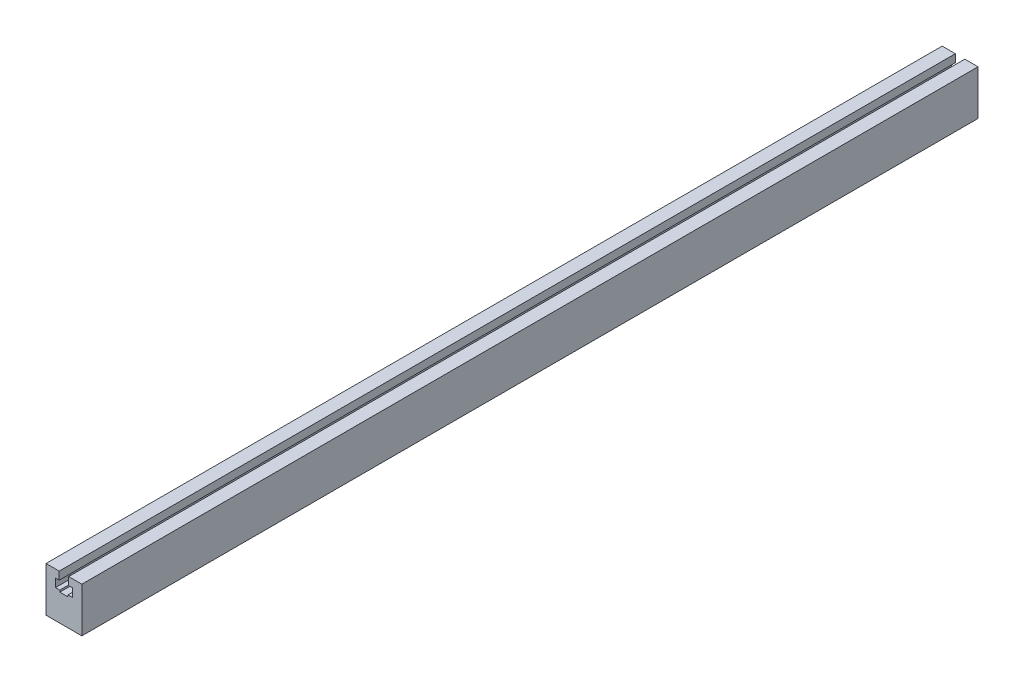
ISO-10303-21;
HEADER;
FILE_DESCRIPTION(('STEP AP214'),'2;1');
FILE_NAME('part.step','',(''),(''),'','','');
FILE_SCHEMA(('AUTOMOTIVE_DESIGN { 1 0 10303 214 1 1 1 1 }'));
ENDSEC;
DATA;
#1=APPLICATION_CONTEXT('core data for automotive mechanical design processes');
#2=APPLICATION_PROTOCOL_DEFINITION('international standard','automotive_design',2000,#1);
#3=PRODUCT_CONTEXT('',#1,'mechanical');
#4=PRODUCT('Part','Part','',(#3));
#5=PRODUCT_RELATED_PRODUCT_CATEGORY('part','',(#4));
#6=PRODUCT_DEFINITION_FORMATION('','',#4);
#7=PRODUCT_DEFINITION_CONTEXT('part definition',#1,'design');
#8=PRODUCT_DEFINITION('design','',#6,#7);
#9=PRODUCT_DEFINITION_SHAPE('','',#8);
#10=(LENGTH_UNIT() NAMED_UNIT(*) SI_UNIT(.MILLI.,.METRE.));
#11=(NAMED_UNIT(*) PLANE_ANGLE_UNIT() SI_UNIT($,.RADIAN.));
#12=(NAMED_UNIT(*) SI_UNIT($,.STERADIAN.) SOLID_ANGLE_UNIT());
#13=UNCERTAINTY_MEASURE_WITH_UNIT(LENGTH_MEASURE(1.E-05),#10,'distance_accuracy_value','');
#14=(GEOMETRIC_REPRESENTATION_CONTEXT(3) GLOBAL_UNCERTAINTY_ASSIGNED_CONTEXT((#13)) GLOBAL_UNIT_ASSIGNED_CONTEXT((#10,
#11,#12)) REPRESENTATION_CONTEXT('',''));
#15=CARTESIAN_POINT('',(0.,0.,0.));
#16=DIRECTION('',(0.,0.,1.));
#17=DIRECTION('',(1.,0.,0.));
#18=AXIS2_PLACEMENT_3D('',#15,#16,#17);
#19=CARTESIAN_POINT('',(4.7,16.,0.));
#20=DIRECTION('',(0.,1.,0.));
#21=DIRECTION('',(-1.,0.,0.));
#22=AXIS2_PLACEMENT_3D('',#19,#20,#21);
#23=PLANE('',#22);
#24=DIRECTION('',(0.,0.,1.));
#25=VECTOR('',#24,1.);
#26=CARTESIAN_POINT('',(-2.3,16.,0.));
#27=LINE('',#26,#25);
#28=CARTESIAN_POINT('',(-2.3,16.,0.));
#29=VERTEX_POINT('',#28);
#30=CARTESIAN_POINT('',(-2.3,16.,500.));
#31=VERTEX_POINT('',#30);
#32=EDGE_CURVE('E153',#29,#31,#27,.T.);
#33=ORIENTED_EDGE('',*,*,#32,.F.);
#34=DIRECTION('',(-1.,0.,0.));
#35=VECTOR('',#34,1.);
#36=CARTESIAN_POINT('',(4.7,16.,0.));
#37=LINE('',#36,#35);
#38=CARTESIAN_POINT('',(-4.70000000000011,16.,0.));
#39=VERTEX_POINT('',#38);
#40=EDGE_CURVE('E222',#29,#39,#37,.T.);
#41=ORIENTED_EDGE('',*,*,#40,.T.);
#42=DIRECTION('',(0.,0.,1.));
#43=VECTOR('',#42,1.);
#44=CARTESIAN_POINT('',(-4.70000000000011,16.,0.));
#45=LINE('',#44,#43);
#46=CARTESIAN_POINT('',(-4.70000000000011,16.,500.));
#47=VERTEX_POINT('',#46);
#48=EDGE_CURVE('E182',#39,#47,#45,.T.);
#49=ORIENTED_EDGE('',*,*,#48,.T.);
#50=DIRECTION('',(-1.,0.,0.));
#51=VECTOR('',#50,1.);
#52=CARTESIAN_POINT('',(4.7,16.,500.));
#53=LINE('',#52,#51);
#54=EDGE_CURVE('E167',#31,#47,#53,.T.);
#55=ORIENTED_EDGE('',*,*,#54,.F.);
#56=EDGE_LOOP('',(#33,#41,#49,#55));
#57=FACE_BOUND('',#56,.T.);
#58=ADVANCED_FACE('F14',(#57),#23,.T.);
#59=CARTESIAN_POINT('',(-10.,25.,0.));
#60=DIRECTION('',(-1.,0.,0.));
#61=DIRECTION('',(0.,0.,1.));
#62=AXIS2_PLACEMENT_3D('',#59,#60,#61);
#63=PLANE('',#62);
#64=DIRECTION('',(0.,-1.,0.));
#65=VECTOR('',#64,1.);
#66=CARTESIAN_POINT('',(-10.,25.,500.));
#67=LINE('',#66,#65);
#68=CARTESIAN_POINT('',(-10.,25.,500.));
#69=VERTEX_POINT('',#68);
#70=CARTESIAN_POINT('',(-10.,0.,500.));
#71=VERTEX_POINT('',#70);
#72=EDGE_CURVE('E149',#69,#71,#67,.T.);
#73=ORIENTED_EDGE('',*,*,#72,.F.);
#74=DIRECTION('',(0.,0.,1.));
#75=VECTOR('',#74,1.);
#76=CARTESIAN_POINT('',(-10.,25.,0.));
#77=LINE('',#76,#75);
#78=CARTESIAN_POINT('',(-10.,25.,0.));
#79=VERTEX_POINT('',#78);
#80=EDGE_CURVE('E9',#79,#69,#77,.T.);
#81=ORIENTED_EDGE('',*,*,#80,.F.);
#82=DIRECTION('',(0.,-1.,0.));
#83=VECTOR('',#82,1.);
#84=CARTESIAN_POINT('',(-10.,25.,0.));
#85=LINE('',#84,#83);
#86=CARTESIAN_POINT('',(-10.,0.,0.));
#87=VERTEX_POINT('',#86);
#88=EDGE_CURVE('E178',#79,#87,#85,.T.);
#89=ORIENTED_EDGE('',*,*,#88,.T.);
#90=DIRECTION('',(0.,0.,1.));
#91=VECTOR('',#90,1.);
#92=CARTESIAN_POINT('',(-10.,0.,0.));
#93=LINE('',#92,#91);
#94=EDGE_CURVE('E18',#87,#71,#93,.T.);
#95=ORIENTED_EDGE('',*,*,#94,.T.);
#96=EDGE_LOOP('',(#73,#81,#89,#95));
#97=FACE_BOUND('',#96,.T.);
#98=ADVANCED_FACE('F16',(#97),#63,.T.);
#99=CARTESIAN_POINT('',(-10.,25.,0.));
#100=DIRECTION('',(0.,-1.,0.));
#101=DIRECTION('',(0.,0.,-1.));
#102=AXIS2_PLACEMENT_3D('',#99,#100,#101);
#103=PLANE('',#102);
#104=DIRECTION('',(1.,0.,0.));
#105=VECTOR('',#104,1.);
#106=CARTESIAN_POINT('',(-10.,25.,500.));
#107=LINE('',#106,#105);
#108=CARTESIAN_POINT('',(-2.64999999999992,25.,500.));
#109=VERTEX_POINT('',#108);
#110=EDGE_CURVE('E177',#69,#109,#107,.T.);
#111=ORIENTED_EDGE('',*,*,#110,.T.);
#112=DIRECTION('',(0.,0.,1.));
#113=VECTOR('',#112,1.);
#114=CARTESIAN_POINT('',(-2.64999999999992,25.,0.));
#115=LINE('',#114,#113);
#116=CARTESIAN_POINT('',(-2.64999999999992,25.,0.));
#117=VERTEX_POINT('',#116);
#118=EDGE_CURVE('E23',#117,#109,#115,.T.);
#119=ORIENTED_EDGE('',*,*,#118,.F.);
#120=DIRECTION('',(1.,0.,0.));
#121=VECTOR('',#120,1.);
#122=CARTESIAN_POINT('',(-10.,25.,0.));
#123=LINE('',#122,#121);
#124=EDGE_CURVE('E143',#79,#117,#123,.T.);
#125=ORIENTED_EDGE('',*,*,#124,.F.);
#126=ORIENTED_EDGE('',*,*,#80,.T.);
#127=EDGE_LOOP('',(#111,#119,#125,#126));
#128=FACE_BOUND('',#127,.T.);
#129=ADVANCED_FACE('F204',(#128),#103,.F.);
#130=CARTESIAN_POINT('',(-2.6499999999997,20.6,0.));
#131=DIRECTION('',(1.,0.,0.));
#132=DIRECTION('',(0.,1.,0.));
#133=AXIS2_PLACEMENT_3D('',#130,#131,#132);
#134=PLANE('',#133);
#135=DIRECTION('',(0.,1.,0.));
#136=VECTOR('',#135,1.);
#137=CARTESIAN_POINT('',(-2.6499999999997,20.6,500.));
#138=LINE('',#137,#136);
#139=CARTESIAN_POINT('',(-2.6499999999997,20.6,500.));
#140=VERTEX_POINT('',#139);
#141=EDGE_CURVE('E126',#140,#109,#138,.T.);
#142=ORIENTED_EDGE('',*,*,#141,.F.);
#143=DIRECTION('',(0.,0.,1.));
#144=VECTOR('',#143,1.);
#145=CARTESIAN_POINT('',(-2.6499999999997,20.6,0.));
#146=LINE('',#145,#144);
#147=CARTESIAN_POINT('',(-2.6499999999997,20.6,0.));
#148=VERTEX_POINT('',#147);
#149=EDGE_CURVE('E120',#148,#140,#146,.T.);
#150=ORIENTED_EDGE('',*,*,#149,.F.);
#151=DIRECTION('',(0.,1.,0.));
#152=VECTOR('',#151,1.);
#153=CARTESIAN_POINT('',(-2.6499999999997,20.6,0.));
#154=LINE('',#153,#152);
#155=EDGE_CURVE('E124',#148,#117,#154,.T.);
#156=ORIENTED_EDGE('',*,*,#155,.T.);
#157=ORIENTED_EDGE('',*,*,#118,.T.);
#158=EDGE_LOOP('',(#142,#150,#156,#157));
#159=FACE_BOUND('',#158,.T.);
#160=ADVANCED_FACE('F122',(#159),#134,.T.);
#161=CARTESIAN_POINT('',(-2.6499999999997,20.6,0.));
#162=DIRECTION('',(0.,1.,0.));
#163=DIRECTION('',(0.,0.,1.));
#164=AXIS2_PLACEMENT_3D('',#161,#162,#163);
#165=PLANE('',#164);
#166=DIRECTION('',(-1.,0.,0.));
#167=VECTOR('',#166,1.);
#168=CARTESIAN_POINT('',(-2.6499999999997,20.6,500.));
#169=LINE('',#168,#167);
#170=CARTESIAN_POINT('',(-4.70000000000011,20.6,500.));
#171=VERTEX_POINT('',#170);
#172=EDGE_CURVE('E174',#140,#171,#169,.T.);
#173=ORIENTED_EDGE('',*,*,#172,.T.);
#174=DIRECTION('',(0.,0.,1.));
#175=VECTOR('',#174,1.);
#176=CARTESIAN_POINT('',(-4.70000000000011,20.6,0.));
#177=LINE('',#176,#175);
#178=CARTESIAN_POINT('',(-4.70000000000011,20.6,0.));
#179=VERTEX_POINT('',#178);
#180=EDGE_CURVE('E130',#179,#171,#177,.T.);
#181=ORIENTED_EDGE('',*,*,#180,.F.);
#182=DIRECTION('',(-1.,0.,0.));
#183=VECTOR('',#182,1.);
#184=CARTESIAN_POINT('',(-2.6499999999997,20.6,0.));
#185=LINE('',#184,#183);
#186=EDGE_CURVE('E133',#148,#179,#185,.T.);
#187=ORIENTED_EDGE('',*,*,#186,.F.);
#188=ORIENTED_EDGE('',*,*,#149,.T.);
#189=EDGE_LOOP('',(#173,#181,#187,#188));
#190=FACE_BOUND('',#189,.T.);
#191=ADVANCED_FACE('F134',(#190),#165,.F.);
#192=CARTESIAN_POINT('',(-4.70000000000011,16.,0.));
#193=DIRECTION('',(1.,0.,0.));
#194=DIRECTION('',(0.,0.,-1.));
#195=AXIS2_PLACEMENT_3D('',#192,#193,#194);
#196=PLANE('',#195);
#197=DIRECTION('',(0.,1.,0.));
#198=VECTOR('',#197,1.);
#199=CARTESIAN_POINT('',(-4.70000000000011,16.,500.));
#200=LINE('',#199,#198);
#201=EDGE_CURVE('E171',#47,#171,#200,.T.);
#202=ORIENTED_EDGE('',*,*,#201,.F.);
#203=ORIENTED_EDGE('',*,*,#48,.F.);
#204=DIRECTION('',(0.,1.,0.));
#205=VECTOR('',#204,1.);
#206=CARTESIAN_POINT('',(-4.70000000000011,16.,0.));
#207=LINE('',#206,#205);
#208=EDGE_CURVE('E138',#39,#179,#207,.T.);
#209=ORIENTED_EDGE('',*,*,#208,.T.);
#210=ORIENTED_EDGE('',*,*,#180,.T.);
#211=EDGE_LOOP('',(#202,#203,#209,#210));
#212=FACE_BOUND('',#211,.T.);
#213=ADVANCED_FACE('F228',(#212),#196,.T.);
#214=DIRECTION('',(0.,0.,1.));
#215=VECTOR('',#214,1.);
#216=CARTESIAN_POINT('',(2.3,16.,0.));
#217=LINE('',#216,#215);
#218=CARTESIAN_POINT('',(2.3,16.,0.));
#219=VERTEX_POINT('',#218);
#220=CARTESIAN_POINT('',(2.3,16.,500.));
#221=VERTEX_POINT('',#220);
#222=EDGE_CURVE('E239',#219,#221,#217,.T.);
#223=ORIENTED_EDGE('',*,*,#222,.T.);
#224=CARTESIAN_POINT('',(4.7,16.,500.));
#225=VERTEX_POINT('',#224);
#226=EDGE_CURVE('E168',#225,#221,#53,.T.);
#227=ORIENTED_EDGE('',*,*,#226,.F.);
#228=DIRECTION('',(0.,0.,1.));
#229=VECTOR('',#228,1.);
#230=CARTESIAN_POINT('',(4.7,16.,0.));
#231=LINE('',#230,#229);
#232=CARTESIAN_POINT('',(4.7,16.,0.));
#233=VERTEX_POINT('',#232);
#234=EDGE_CURVE('E185',#233,#225,#231,.T.);
#235=ORIENTED_EDGE('',*,*,#234,.F.);
#236=EDGE_CURVE('E223',#233,#219,#37,.T.);
#237=ORIENTED_EDGE('',*,*,#236,.T.);
#238=EDGE_LOOP('',(#223,#227,#235,#237));
#239=FACE_BOUND('',#238,.T.);
#240=ADVANCED_FACE('F272',(#239),#23,.T.);
#241=CARTESIAN_POINT('',(4.7,16.,0.));
#242=DIRECTION('',(1.,0.,0.));
#243=DIRECTION('',(0.,0.,-1.));
#244=AXIS2_PLACEMENT_3D('',#241,#242,#243);
#245=PLANE('',#244);
#246=DIRECTION('',(0.,1.,0.));
#247=VECTOR('',#246,1.);
#248=CARTESIAN_POINT('',(4.7,16.,500.));
#249=LINE('',#248,#247);
#250=CARTESIAN_POINT('',(4.7,20.6,500.));
#251=VERTEX_POINT('',#250);
#252=EDGE_CURVE('E165',#225,#251,#249,.T.);
#253=ORIENTED_EDGE('',*,*,#252,.T.);
#254=DIRECTION('',(0.,0.,1.));
#255=VECTOR('',#254,1.);
#256=CARTESIAN_POINT('',(4.7,20.6,0.));
#257=LINE('',#256,#255);
#258=CARTESIAN_POINT('',(4.7,20.6,0.));
#259=VERTEX_POINT('',#258);
#260=EDGE_CURVE('E187',#259,#251,#257,.T.);
#261=ORIENTED_EDGE('',*,*,#260,.F.);
#262=DIRECTION('',(0.,1.,0.));
#263=VECTOR('',#262,1.);
#264=CARTESIAN_POINT('',(4.7,16.,0.));
#265=LINE('',#264,#263);
#266=EDGE_CURVE('E220',#233,#259,#265,.T.);
#267=ORIENTED_EDGE('',*,*,#266,.F.);
#268=ORIENTED_EDGE('',*,*,#234,.T.);
#269=EDGE_LOOP('',(#253,#261,#267,#268));
#270=FACE_BOUND('',#269,.T.);
#271=ADVANCED_FACE('F278',(#270),#245,.F.);
#272=CARTESIAN_POINT('',(4.7,20.6,0.));
#273=DIRECTION('',(0.,1.,0.));
#274=DIRECTION('',(0.,0.,1.));
#275=AXIS2_PLACEMENT_3D('',#272,#273,#274);
#276=PLANE('',#275);
#277=DIRECTION('',(-1.,0.,0.));
#278=VECTOR('',#277,1.);
#279=CARTESIAN_POINT('',(4.7,20.6,500.));
#280=LINE('',#279,#278);
#281=CARTESIAN_POINT('',(2.65000000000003,20.6,500.));
#282=VERTEX_POINT('',#281);
#283=EDGE_CURVE('E163',#251,#282,#280,.T.);
#284=ORIENTED_EDGE('',*,*,#283,.T.);
#285=DIRECTION('',(0.,0.,1.));
#286=VECTOR('',#285,1.);
#287=CARTESIAN_POINT('',(2.65000000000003,20.6,0.));
#288=LINE('',#287,#286);
#289=CARTESIAN_POINT('',(2.65000000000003,20.6,0.));
#290=VERTEX_POINT('',#289);
#291=EDGE_CURVE('E190',#290,#282,#288,.T.);
#292=ORIENTED_EDGE('',*,*,#291,.F.);
#293=DIRECTION('',(-1.,0.,0.));
#294=VECTOR('',#293,1.);
#295=CARTESIAN_POINT('',(4.7,20.6,0.));
#296=LINE('',#295,#294);
#297=EDGE_CURVE('E218',#259,#290,#296,.T.);
#298=ORIENTED_EDGE('',*,*,#297,.F.);
#299=ORIENTED_EDGE('',*,*,#260,.T.);
#300=EDGE_LOOP('',(#284,#292,#298,#299));
#301=FACE_BOUND('',#300,.T.);
#302=ADVANCED_FACE('F282',(#301),#276,.F.);
#303=CARTESIAN_POINT('',(2.65000000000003,20.6,0.));
#304=DIRECTION('',(1.,0.,0.));
#305=DIRECTION('',(0.,0.,-1.));
#306=AXIS2_PLACEMENT_3D('',#303,#304,#305);
#307=PLANE('',#306);
#308=DIRECTION('',(0.,1.,0.));
#309=VECTOR('',#308,1.);
#310=CARTESIAN_POINT('',(2.65000000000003,20.6,500.));
#311=LINE('',#310,#309);
#312=CARTESIAN_POINT('',(2.65000000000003,25.,500.));
#313=VERTEX_POINT('',#312);
#314=EDGE_CURVE('E161',#282,#313,#311,.T.);
#315=ORIENTED_EDGE('',*,*,#314,.T.);
#316=DIRECTION('',(0.,0.,1.));
#317=VECTOR('',#316,1.);
#318=CARTESIAN_POINT('',(2.65000000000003,25.,0.));
#319=LINE('',#318,#317);
#320=CARTESIAN_POINT('',(2.65000000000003,25.,0.));
#321=VERTEX_POINT('',#320);
#322=EDGE_CURVE('E193',#321,#313,#319,.T.);
#323=ORIENTED_EDGE('',*,*,#322,.F.);
#324=DIRECTION('',(0.,1.,0.));
#325=VECTOR('',#324,1.);
#326=CARTESIAN_POINT('',(2.65000000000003,20.6,0.));
#327=LINE('',#326,#325);
#328=EDGE_CURVE('E216',#290,#321,#327,.T.);
#329=ORIENTED_EDGE('',*,*,#328,.F.);
#330=ORIENTED_EDGE('',*,*,#291,.T.);
#331=EDGE_LOOP('',(#315,#323,#329,#330));
#332=FACE_BOUND('',#331,.T.);
#333=ADVANCED_FACE('F289',(#332),#307,.F.);
#334=CARTESIAN_POINT('',(2.65000000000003,25.,0.));
#335=DIRECTION('',(0.,-1.,0.));
#336=DIRECTION('',(0.,0.,-1.));
#337=AXIS2_PLACEMENT_3D('',#334,#335,#336);
#338=PLANE('',#337);
#339=DIRECTION('',(1.,0.,0.));
#340=VECTOR('',#339,1.);
#341=CARTESIAN_POINT('',(2.65000000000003,25.,500.));
#342=LINE('',#341,#340);
#343=CARTESIAN_POINT('',(10.,25.,500.));
#344=VERTEX_POINT('',#343);
#345=EDGE_CURVE('E159',#313,#344,#342,.T.);
#346=ORIENTED_EDGE('',*,*,#345,.T.);
#347=DIRECTION('',(0.,0.,1.));
#348=VECTOR('',#347,1.);
#349=CARTESIAN_POINT('',(10.,25.,0.));
#350=LINE('',#349,#348);
#351=CARTESIAN_POINT('',(10.,25.,0.));
#352=VERTEX_POINT('',#351);
#353=EDGE_CURVE('E196',#352,#344,#350,.T.);
#354=ORIENTED_EDGE('',*,*,#353,.F.);
#355=DIRECTION('',(1.,0.,0.));
#356=VECTOR('',#355,1.);
#357=CARTESIAN_POINT('',(2.65000000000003,25.,0.));
#358=LINE('',#357,#356);
#359=EDGE_CURVE('E214',#321,#352,#358,.T.);
#360=ORIENTED_EDGE('',*,*,#359,.F.);
#361=ORIENTED_EDGE('',*,*,#322,.T.);
#362=EDGE_LOOP('',(#346,#354,#360,#361));
#363=FACE_BOUND('',#362,.T.);
#364=ADVANCED_FACE('F292',(#363),#338,.F.);
#365=CARTESIAN_POINT('',(10.,25.,0.));
#366=DIRECTION('',(-1.,0.,0.));
#367=DIRECTION('',(0.,0.,1.));
#368=AXIS2_PLACEMENT_3D('',#365,#366,#367);
#369=PLANE('',#368);
#370=DIRECTION('',(0.,-1.,0.));
#371=VECTOR('',#370,1.);
#372=CARTESIAN_POINT('',(10.,25.,500.));
#373=LINE('',#372,#371);
#374=CARTESIAN_POINT('',(10.,0.,500.));
#375=VERTEX_POINT('',#374);
#376=EDGE_CURVE('E156',#344,#375,#373,.T.);
#377=ORIENTED_EDGE('',*,*,#376,.T.);
#378=DIRECTION('',(0.,0.,1.));
#379=VECTOR('',#378,1.);
#380=CARTESIAN_POINT('',(10.,0.,0.));
#381=LINE('',#380,#379);
#382=CARTESIAN_POINT('',(10.,0.,0.));
#383=VERTEX_POINT('',#382);
#384=EDGE_CURVE('E198',#383,#375,#381,.T.);
#385=ORIENTED_EDGE('',*,*,#384,.F.);
#386=DIRECTION('',(0.,-1.,0.));
#387=VECTOR('',#386,1.);
#388=CARTESIAN_POINT('',(10.,25.,0.));
#389=LINE('',#388,#387);
#390=EDGE_CURVE('E207',#352,#383,#389,.T.);
#391=ORIENTED_EDGE('',*,*,#390,.F.);
#392=ORIENTED_EDGE('',*,*,#353,.T.);
#393=EDGE_LOOP('',(#377,#385,#391,#392));
#394=FACE_BOUND('',#393,.T.);
#395=ADVANCED_FACE('F295',(#394),#369,.F.);
#396=CARTESIAN_POINT('',(-10.,0.,0.));
#397=DIRECTION('',(0.,-1.,0.));
#398=DIRECTION('',(0.,0.,-1.));
#399=AXIS2_PLACEMENT_3D('',#396,#397,#398);
#400=PLANE('',#399);
#401=DIRECTION('',(1.,0.,0.));
#402=VECTOR('',#401,1.);
#403=CARTESIAN_POINT('',(-10.,0.,500.));
#404=LINE('',#403,#402);
#405=EDGE_CURVE('E152',#71,#375,#404,.T.);
#406=ORIENTED_EDGE('',*,*,#405,.F.);
#407=ORIENTED_EDGE('',*,*,#94,.F.);
#408=DIRECTION('',(1.,0.,0.));
#409=VECTOR('',#408,1.);
#410=CARTESIAN_POINT('',(-10.,0.,0.));
#411=LINE('',#410,#409);
#412=EDGE_CURVE('E205',#87,#383,#411,.T.);
#413=ORIENTED_EDGE('',*,*,#412,.T.);
#414=ORIENTED_EDGE('',*,*,#384,.T.);
#415=EDGE_LOOP('',(#406,#407,#413,#414));
#416=FACE_BOUND('',#415,.T.);
#417=ADVANCED_FACE('F200',(#416),#400,.T.);
#418=CARTESIAN_POINT('',(-10.,0.,0.));
#419=DIRECTION('',(0.,0.,1.));
#420=DIRECTION('',(1.,0.,0.));
#421=AXIS2_PLACEMENT_3D('',#418,#419,#420);
#422=PLANE('',#421);
#423=ORIENTED_EDGE('',*,*,#40,.F.);
#424=DIRECTION('',(0.,-1.,0.));
#425=VECTOR('',#424,1.);
#426=CARTESIAN_POINT('',(-2.3,16.,0.));
#427=LINE('',#426,#425);
#428=CARTESIAN_POINT('',(-2.3,15.,0.));
#429=VERTEX_POINT('',#428);
#430=EDGE_CURVE('E233',#29,#429,#427,.T.);
#431=ORIENTED_EDGE('',*,*,#430,.T.);
#432=DIRECTION('',(1.,0.,0.));
#433=VECTOR('',#432,1.);
#434=CARTESIAN_POINT('',(-2.3,15.,0.));
#435=LINE('',#434,#433);
#436=CARTESIAN_POINT('',(2.3,15.,0.));
#437=VERTEX_POINT('',#436);
#438=EDGE_CURVE('E259',#429,#437,#435,.T.);
#439=ORIENTED_EDGE('',*,*,#438,.T.);
#440=DIRECTION('',(0.,1.,0.));
#441=VECTOR('',#440,1.);
#442=CARTESIAN_POINT('',(2.3,16.,0.));
#443=LINE('',#442,#441);
#444=EDGE_CURVE('E254',#437,#219,#443,.T.);
#445=ORIENTED_EDGE('',*,*,#444,.T.);
#446=ORIENTED_EDGE('',*,*,#236,.F.);
#447=ORIENTED_EDGE('',*,*,#266,.T.);
#448=ORIENTED_EDGE('',*,*,#297,.T.);
#449=ORIENTED_EDGE('',*,*,#328,.T.);
#450=ORIENTED_EDGE('',*,*,#359,.T.);
#451=ORIENTED_EDGE('',*,*,#390,.T.);
#452=ORIENTED_EDGE('',*,*,#412,.F.);
#453=ORIENTED_EDGE('',*,*,#88,.F.);
#454=ORIENTED_EDGE('',*,*,#124,.T.);
#455=ORIENTED_EDGE('',*,*,#155,.F.);
#456=ORIENTED_EDGE('',*,*,#186,.T.);
#457=ORIENTED_EDGE('',*,*,#208,.F.);
#458=EDGE_LOOP('',(#423,#431,#439,#445,#446,#447,#448,#449,#450,#451,#452,#453,#454,#455,#456,#457));
#459=FACE_BOUND('',#458,.T.);
#460=ADVANCED_FACE('F141',(#459),#422,.F.);
#461=CARTESIAN_POINT('',(-10.,0.,500.));
#462=DIRECTION('',(0.,0.,1.));
#463=DIRECTION('',(1.,0.,0.));
#464=AXIS2_PLACEMENT_3D('',#461,#462,#463);
#465=PLANE('',#464);
#466=DIRECTION('',(0.,-1.,0.));
#467=VECTOR('',#466,1.);
#468=CARTESIAN_POINT('',(-2.3,16.,500.));
#469=LINE('',#468,#467);
#470=CARTESIAN_POINT('',(-2.3,15.,500.));
#471=VERTEX_POINT('',#470);
#472=EDGE_CURVE('E31',#31,#471,#469,.T.);
#473=ORIENTED_EDGE('',*,*,#472,.F.);
#474=ORIENTED_EDGE('',*,*,#54,.T.);
#475=ORIENTED_EDGE('',*,*,#201,.T.);
#476=ORIENTED_EDGE('',*,*,#172,.F.);
#477=ORIENTED_EDGE('',*,*,#141,.T.);
#478=ORIENTED_EDGE('',*,*,#110,.F.);
#479=ORIENTED_EDGE('',*,*,#72,.T.);
#480=ORIENTED_EDGE('',*,*,#405,.T.);
#481=ORIENTED_EDGE('',*,*,#376,.F.);
#482=ORIENTED_EDGE('',*,*,#345,.F.);
#483=ORIENTED_EDGE('',*,*,#314,.F.);
#484=ORIENTED_EDGE('',*,*,#283,.F.);
#485=ORIENTED_EDGE('',*,*,#252,.F.);
#486=ORIENTED_EDGE('',*,*,#226,.T.);
#487=DIRECTION('',(0.,1.,0.));
#488=VECTOR('',#487,1.);
#489=CARTESIAN_POINT('',(2.3,16.,500.));
#490=LINE('',#489,#488);
#491=CARTESIAN_POINT('',(2.3,15.,500.));
#492=VERTEX_POINT('',#491);
#493=EDGE_CURVE('E245',#492,#221,#490,.T.);
#494=ORIENTED_EDGE('',*,*,#493,.F.);
#495=DIRECTION('',(1.,0.,0.));
#496=VECTOR('',#495,1.);
#497=CARTESIAN_POINT('',(-2.3,15.,500.));
#498=LINE('',#497,#496);
#499=EDGE_CURVE('E265',#471,#492,#498,.T.);
#500=ORIENTED_EDGE('',*,*,#499,.F.);
#501=EDGE_LOOP('',(#473,#474,#475,#476,#477,#478,#479,#480,#481,#482,#483,#484,#485,#486,#494,#500));
#502=FACE_BOUND('',#501,.T.);
#503=ADVANCED_FACE('F203',(#502),#465,.T.);
#504=CARTESIAN_POINT('',(-2.3,16.,0.));
#505=DIRECTION('',(-1.,0.,0.));
#506=DIRECTION('',(0.,0.,1.));
#507=AXIS2_PLACEMENT_3D('',#504,#505,#506);
#508=PLANE('',#507);
#509=ORIENTED_EDGE('',*,*,#472,.T.);
#510=DIRECTION('',(0.,0.,1.));
#511=VECTOR('',#510,1.);
#512=CARTESIAN_POINT('',(-2.3,15.,0.));
#513=LINE('',#512,#511);
#514=EDGE_CURVE('E210',#429,#471,#513,.T.);
#515=ORIENTED_EDGE('',*,*,#514,.F.);
#516=ORIENTED_EDGE('',*,*,#430,.F.);
#517=ORIENTED_EDGE('',*,*,#32,.T.);
#518=EDGE_LOOP('',(#509,#515,#516,#517));
#519=FACE_BOUND('',#518,.T.);
#520=ADVANCED_FACE('F331',(#519),#508,.F.);
#521=CARTESIAN_POINT('',(2.3,16.,0.));
#522=DIRECTION('',(1.,0.,0.));
#523=DIRECTION('',(0.,0.,-1.));
#524=AXIS2_PLACEMENT_3D('',#521,#522,#523);
#525=PLANE('',#524);
#526=ORIENTED_EDGE('',*,*,#493,.T.);
#527=ORIENTED_EDGE('',*,*,#222,.F.);
#528=ORIENTED_EDGE('',*,*,#444,.F.);
#529=DIRECTION('',(0.,0.,1.));
#530=VECTOR('',#529,1.);
#531=CARTESIAN_POINT('',(2.3,15.,0.));
#532=LINE('',#531,#530);
#533=EDGE_CURVE('E242',#437,#492,#532,.T.);
#534=ORIENTED_EDGE('',*,*,#533,.T.);
#535=EDGE_LOOP('',(#526,#527,#528,#534));
#536=FACE_BOUND('',#535,.T.);
#537=ADVANCED_FACE('F269',(#536),#525,.F.);
#538=CARTESIAN_POINT('',(-2.3,15.,0.));
#539=DIRECTION('',(0.,-1.,0.));
#540=DIRECTION('',(0.,0.,-1.));
#541=AXIS2_PLACEMENT_3D('',#538,#539,#540);
#542=PLANE('',#541);
#543=ORIENTED_EDGE('',*,*,#499,.T.);
#544=ORIENTED_EDGE('',*,*,#533,.F.);
#545=ORIENTED_EDGE('',*,*,#438,.F.);
#546=ORIENTED_EDGE('',*,*,#514,.T.);
#547=EDGE_LOOP('',(#543,#544,#545,#546));
#548=FACE_BOUND('',#547,.T.);
#549=ADVANCED_FACE('F336',(#548),#542,.F.);
#550=CLOSED_SHELL('',(#58,#98,#129,#160,#191,#213,#240,#271,#302,#333,#364,#395,#417,#460,#503,
#520,#537,#549));
#551=MANIFOLD_SOLID_BREP('B1',#550);
#552=ADVANCED_BREP_SHAPE_REPRESENTATION('',(#18,#551),#14);
#553=SHAPE_DEFINITION_REPRESENTATION(#9,#552);
ENDSEC;
END-ISO-10303-21;
